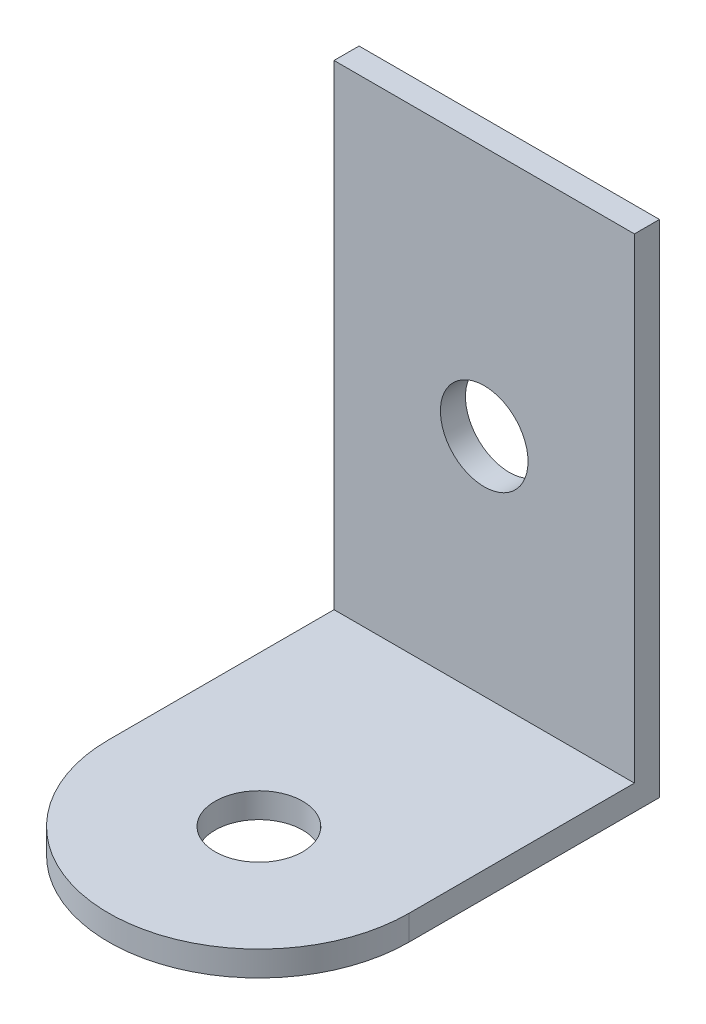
ISO-10303-21;
HEADER;
FILE_DESCRIPTION(('STEP AP214'),'2;1');
FILE_NAME('part.step','',(''),(''),'','','');
FILE_SCHEMA(('AUTOMOTIVE_DESIGN { 1 0 10303 214 1 1 1 1 }'));
ENDSEC;
DATA;
#1=APPLICATION_CONTEXT('core data for automotive mechanical design processes');
#2=APPLICATION_PROTOCOL_DEFINITION('international standard','automotive_design',2000,#1);
#3=PRODUCT_CONTEXT('',#1,'mechanical');
#4=PRODUCT('Part','Part','',(#3));
#5=PRODUCT_RELATED_PRODUCT_CATEGORY('part','',(#4));
#6=PRODUCT_DEFINITION_FORMATION('','',#4);
#7=PRODUCT_DEFINITION_CONTEXT('part definition',#1,'design');
#8=PRODUCT_DEFINITION('design','',#6,#7);
#9=PRODUCT_DEFINITION_SHAPE('','',#8);
#10=(LENGTH_UNIT() NAMED_UNIT(*) SI_UNIT(.MILLI.,.METRE.));
#11=(NAMED_UNIT(*) PLANE_ANGLE_UNIT() SI_UNIT($,.RADIAN.));
#12=(NAMED_UNIT(*) SI_UNIT($,.STERADIAN.) SOLID_ANGLE_UNIT());
#13=UNCERTAINTY_MEASURE_WITH_UNIT(LENGTH_MEASURE(1.E-05),#10,'distance_accuracy_value','');
#14=(GEOMETRIC_REPRESENTATION_CONTEXT(3) GLOBAL_UNCERTAINTY_ASSIGNED_CONTEXT((#13)) GLOBAL_UNIT_ASSIGNED_CONTEXT((#10,
#11,#12)) REPRESENTATION_CONTEXT('',''));
#15=CARTESIAN_POINT('',(0.,0.,0.));
#16=DIRECTION('',(0.,0.,1.));
#17=DIRECTION('',(1.,0.,0.));
#18=AXIS2_PLACEMENT_3D('',#15,#16,#17);
#19=CARTESIAN_POINT('',(0.,20.,1.));
#20=DIRECTION('',(0.,0.,-1.));
#21=DIRECTION('',(-1.,0.,0.));
#22=AXIS2_PLACEMENT_3D('',#19,#20,#21);
#23=PLANE('',#22);
#24=CARTESIAN_POINT('',(6.,10.,1.));
#25=DIRECTION('',(0.,0.,1.));
#26=DIRECTION('',(1.,0.,0.));
#27=AXIS2_PLACEMENT_3D('',#24,#25,#26);
#28=CIRCLE('',#27,1.75);
#29=CARTESIAN_POINT('',(7.75,10.,1.));
#30=VERTEX_POINT('',#29);
#31=EDGE_CURVE('E113',#30,#30,#28,.T.);
#32=ORIENTED_EDGE('',*,*,#31,.F.);
#33=EDGE_LOOP('',(#32));
#34=FACE_BOUND('',#33,.T.);
#35=DIRECTION('',(-1.,0.,0.));
#36=VECTOR('',#35,1.);
#37=CARTESIAN_POINT('',(0.,1.,1.));
#38=LINE('',#37,#36);
#39=CARTESIAN_POINT('',(12.,1.,1.));
#40=VERTEX_POINT('',#39);
#41=CARTESIAN_POINT('',(0.,1.,1.));
#42=VERTEX_POINT('',#41);
#43=EDGE_CURVE('E49',#40,#42,#38,.T.);
#44=ORIENTED_EDGE('',*,*,#43,.F.);
#45=DIRECTION('',(0.,1.,0.));
#46=VECTOR('',#45,1.);
#47=CARTESIAN_POINT('',(12.,0.,1.));
#48=LINE('',#47,#46);
#49=CARTESIAN_POINT('',(12.,20.,1.));
#50=VERTEX_POINT('',#49);
#51=EDGE_CURVE('E88',#40,#50,#48,.T.);
#52=ORIENTED_EDGE('',*,*,#51,.T.);
#53=DIRECTION('',(-1.,0.,0.));
#54=VECTOR('',#53,1.);
#55=CARTESIAN_POINT('',(0.,20.,1.));
#56=LINE('',#55,#54);
#57=CARTESIAN_POINT('',(0.,20.,1.));
#58=VERTEX_POINT('',#57);
#59=EDGE_CURVE('E122',#50,#58,#56,.T.);
#60=ORIENTED_EDGE('',*,*,#59,.T.);
#61=DIRECTION('',(0.,-1.,0.));
#62=VECTOR('',#61,1.);
#63=CARTESIAN_POINT('',(0.,0.,1.));
#64=LINE('',#63,#62);
#65=EDGE_CURVE('E45',#58,#42,#64,.T.);
#66=ORIENTED_EDGE('',*,*,#65,.T.);
#67=EDGE_LOOP('',(#44,#52,#60,#66));
#68=FACE_BOUND('',#67,.T.);
#69=ADVANCED_FACE('F30',(#34,#68),#23,.F.);
#70=CARTESIAN_POINT('',(0.,20.,0.));
#71=DIRECTION('',(0.,0.,-1.));
#72=DIRECTION('',(-1.,0.,0.));
#73=AXIS2_PLACEMENT_3D('',#70,#71,#72);
#74=PLANE('',#73);
#75=DIRECTION('',(1.,0.,0.));
#76=VECTOR('',#75,1.);
#77=CARTESIAN_POINT('',(0.,0.,0.));
#78=LINE('',#77,#76);
#79=CARTESIAN_POINT('',(0.,0.,0.));
#80=VERTEX_POINT('',#79);
#81=CARTESIAN_POINT('',(12.,0.,0.));
#82=VERTEX_POINT('',#81);
#83=EDGE_CURVE('E126',#80,#82,#78,.T.);
#84=ORIENTED_EDGE('',*,*,#83,.F.);
#85=DIRECTION('',(0.,-1.,0.));
#86=VECTOR('',#85,1.);
#87=CARTESIAN_POINT('',(0.,0.,0.));
#88=LINE('',#87,#86);
#89=CARTESIAN_POINT('',(0.,20.,0.));
#90=VERTEX_POINT('',#89);
#91=EDGE_CURVE('E116',#90,#80,#88,.T.);
#92=ORIENTED_EDGE('',*,*,#91,.F.);
#93=DIRECTION('',(-1.,0.,0.));
#94=VECTOR('',#93,1.);
#95=CARTESIAN_POINT('',(0.,20.,0.));
#96=LINE('',#95,#94);
#97=CARTESIAN_POINT('',(12.,20.,0.));
#98=VERTEX_POINT('',#97);
#99=EDGE_CURVE('E120',#98,#90,#96,.T.);
#100=ORIENTED_EDGE('',*,*,#99,.F.);
#101=DIRECTION('',(0.,1.,0.));
#102=VECTOR('',#101,1.);
#103=CARTESIAN_POINT('',(12.,0.,0.));
#104=LINE('',#103,#102);
#105=EDGE_CURVE('E128',#82,#98,#104,.T.);
#106=ORIENTED_EDGE('',*,*,#105,.F.);
#107=EDGE_LOOP('',(#84,#92,#100,#106));
#108=FACE_BOUND('',#107,.T.);
#109=CARTESIAN_POINT('',(6.,10.,0.));
#110=DIRECTION('',(0.,0.,1.));
#111=DIRECTION('',(1.,0.,0.));
#112=AXIS2_PLACEMENT_3D('',#109,#110,#111);
#113=CIRCLE('',#112,1.75);
#114=CARTESIAN_POINT('',(7.75,10.,0.));
#115=VERTEX_POINT('',#114);
#116=EDGE_CURVE('E112',#115,#115,#113,.T.);
#117=ORIENTED_EDGE('',*,*,#116,.T.);
#118=EDGE_LOOP('',(#117));
#119=FACE_BOUND('',#118,.T.);
#120=ADVANCED_FACE('F140',(#108,#119),#74,.T.);
#121=CARTESIAN_POINT('',(0.,0.,1.));
#122=DIRECTION('',(1.,0.,0.));
#123=DIRECTION('',(0.,1.,0.));
#124=AXIS2_PLACEMENT_3D('',#121,#122,#123);
#125=PLANE('',#124);
#126=DIRECTION('',(0.,0.,-1.));
#127=VECTOR('',#126,1.);
#128=CARTESIAN_POINT('',(0.,0.,1.));
#129=LINE('',#128,#127);
#130=CARTESIAN_POINT('',(0.,0.,10.));
#131=VERTEX_POINT('',#130);
#132=EDGE_CURVE('E11',#131,#80,#129,.T.);
#133=ORIENTED_EDGE('',*,*,#132,.F.);
#134=DIRECTION('',(0.,-1.,0.));
#135=VECTOR('',#134,1.);
#136=CARTESIAN_POINT('',(0.,1.,10.));
#137=LINE('',#136,#135);
#138=CARTESIAN_POINT('',(0.,1.,10.));
#139=VERTEX_POINT('',#138);
#140=EDGE_CURVE('E100',#139,#131,#137,.T.);
#141=ORIENTED_EDGE('',*,*,#140,.F.);
#142=DIRECTION('',(0.,0.,-1.));
#143=VECTOR('',#142,1.);
#144=CARTESIAN_POINT('',(0.,1.,0.));
#145=LINE('',#144,#143);
#146=EDGE_CURVE('E92',#139,#42,#145,.T.);
#147=ORIENTED_EDGE('',*,*,#146,.T.);
#148=ORIENTED_EDGE('',*,*,#65,.F.);
#149=DIRECTION('',(0.,0.,-1.));
#150=VECTOR('',#149,1.);
#151=CARTESIAN_POINT('',(0.,20.,1.));
#152=LINE('',#151,#150);
#153=EDGE_CURVE('E124',#58,#90,#152,.T.);
#154=ORIENTED_EDGE('',*,*,#153,.T.);
#155=ORIENTED_EDGE('',*,*,#91,.T.);
#156=EDGE_LOOP('',(#133,#141,#147,#148,#154,#155));
#157=FACE_BOUND('',#156,.T.);
#158=ADVANCED_FACE('F32',(#157),#125,.F.);
#159=CARTESIAN_POINT('',(0.,0.,1.));
#160=DIRECTION('',(0.,1.,0.));
#161=DIRECTION('',(-1.,0.,0.));
#162=AXIS2_PLACEMENT_3D('',#159,#160,#161);
#163=PLANE('',#162);
#164=ORIENTED_EDGE('',*,*,#83,.T.);
#165=DIRECTION('',(0.,0.,-1.));
#166=VECTOR('',#165,1.);
#167=CARTESIAN_POINT('',(12.,0.,1.));
#168=LINE('',#167,#166);
#169=CARTESIAN_POINT('',(12.,0.,10.));
#170=VERTEX_POINT('',#169);
#171=EDGE_CURVE('E38',#170,#82,#168,.T.);
#172=ORIENTED_EDGE('',*,*,#171,.F.);
#173=CARTESIAN_POINT('',(6.,0.,10.));
#174=DIRECTION('',(0.,-1.,0.));
#175=DIRECTION('',(1.,0.,0.));
#176=AXIS2_PLACEMENT_3D('',#173,#174,#175);
#177=CIRCLE('',#176,6.);
#178=EDGE_CURVE('E99',#170,#131,#177,.T.);
#179=ORIENTED_EDGE('',*,*,#178,.T.);
#180=ORIENTED_EDGE('',*,*,#132,.T.);
#181=EDGE_LOOP('',(#164,#172,#179,#180));
#182=FACE_BOUND('',#181,.T.);
#183=CARTESIAN_POINT('',(6.,0.,10.));
#184=DIRECTION('',(0.,-1.,0.));
#185=DIRECTION('',(1.,0.,0.));
#186=AXIS2_PLACEMENT_3D('',#183,#184,#185);
#187=CIRCLE('',#186,1.75);
#188=CARTESIAN_POINT('',(7.75,0.,10.));
#189=VERTEX_POINT('',#188);
#190=EDGE_CURVE('E149',#189,#189,#187,.T.);
#191=ORIENTED_EDGE('',*,*,#190,.F.);
#192=EDGE_LOOP('',(#191));
#193=FACE_BOUND('',#192,.T.);
#194=ADVANCED_FACE('F162',(#182,#193),#163,.F.);
#195=CARTESIAN_POINT('',(12.,0.,1.));
#196=DIRECTION('',(-1.,0.,0.));
#197=DIRECTION('',(0.,0.,1.));
#198=AXIS2_PLACEMENT_3D('',#195,#196,#197);
#199=PLANE('',#198);
#200=ORIENTED_EDGE('',*,*,#105,.T.);
#201=DIRECTION('',(0.,0.,-1.));
#202=VECTOR('',#201,1.);
#203=CARTESIAN_POINT('',(12.,20.,1.));
#204=LINE('',#203,#202);
#205=EDGE_CURVE('E133',#50,#98,#204,.T.);
#206=ORIENTED_EDGE('',*,*,#205,.F.);
#207=ORIENTED_EDGE('',*,*,#51,.F.);
#208=DIRECTION('',(0.,0.,1.));
#209=VECTOR('',#208,1.);
#210=CARTESIAN_POINT('',(12.,1.,0.));
#211=LINE('',#210,#209);
#212=CARTESIAN_POINT('',(12.,1.,10.));
#213=VERTEX_POINT('',#212);
#214=EDGE_CURVE('E81',#40,#213,#211,.T.);
#215=ORIENTED_EDGE('',*,*,#214,.T.);
#216=DIRECTION('',(0.,-1.,0.));
#217=VECTOR('',#216,1.);
#218=CARTESIAN_POINT('',(12.,1.,10.));
#219=LINE('',#218,#217);
#220=EDGE_CURVE('E85',#213,#170,#219,.T.);
#221=ORIENTED_EDGE('',*,*,#220,.T.);
#222=ORIENTED_EDGE('',*,*,#171,.T.);
#223=EDGE_LOOP('',(#200,#206,#207,#215,#221,#222));
#224=FACE_BOUND('',#223,.T.);
#225=ADVANCED_FACE('F83',(#224),#199,.F.);
#226=CARTESIAN_POINT('',(0.,20.,1.));
#227=DIRECTION('',(0.,-1.,0.));
#228=DIRECTION('',(1.,0.,0.));
#229=AXIS2_PLACEMENT_3D('',#226,#227,#228);
#230=PLANE('',#229);
#231=ORIENTED_EDGE('',*,*,#99,.T.);
#232=ORIENTED_EDGE('',*,*,#153,.F.);
#233=ORIENTED_EDGE('',*,*,#59,.F.);
#234=ORIENTED_EDGE('',*,*,#205,.T.);
#235=EDGE_LOOP('',(#231,#232,#233,#234));
#236=FACE_BOUND('',#235,.T.);
#237=ADVANCED_FACE('F145',(#236),#230,.F.);
#238=CARTESIAN_POINT('',(6.,10.,1.));
#239=DIRECTION('',(0.,0.,-1.));
#240=DIRECTION('',(-1.,0.,0.));
#241=AXIS2_PLACEMENT_3D('',#238,#239,#240);
#242=CYLINDRICAL_SURFACE('',#241,1.75);
#243=ORIENTED_EDGE('',*,*,#31,.T.);
#244=EDGE_LOOP('',(#243));
#245=FACE_BOUND('',#244,.T.);
#246=ORIENTED_EDGE('',*,*,#116,.F.);
#247=EDGE_LOOP('',(#246));
#248=FACE_BOUND('',#247,.T.);
#249=ADVANCED_FACE('F178',(#245,#248),#242,.F.);
#250=CARTESIAN_POINT('',(6.,1.,10.));
#251=DIRECTION('',(0.,-1.,0.));
#252=DIRECTION('',(1.,0.,0.));
#253=AXIS2_PLACEMENT_3D('',#250,#251,#252);
#254=PLANE('',#253);
#255=CARTESIAN_POINT('',(6.,1.,10.));
#256=DIRECTION('',(0.,-1.,0.));
#257=DIRECTION('',(1.,0.,0.));
#258=AXIS2_PLACEMENT_3D('',#255,#256,#257);
#259=CIRCLE('',#258,1.75);
#260=CARTESIAN_POINT('',(7.75,1.,10.));
#261=VERTEX_POINT('',#260);
#262=EDGE_CURVE('E109',#261,#261,#259,.T.);
#263=ORIENTED_EDGE('',*,*,#262,.T.);
#264=EDGE_LOOP('',(#263));
#265=FACE_BOUND('',#264,.T.);
#266=ORIENTED_EDGE('',*,*,#214,.F.);
#267=ORIENTED_EDGE('',*,*,#43,.T.);
#268=ORIENTED_EDGE('',*,*,#146,.F.);
#269=CARTESIAN_POINT('',(6.,1.,10.));
#270=DIRECTION('',(0.,-1.,0.));
#271=DIRECTION('',(1.,0.,0.));
#272=AXIS2_PLACEMENT_3D('',#269,#270,#271);
#273=CIRCLE('',#272,6.);
#274=EDGE_CURVE('E91',#213,#139,#273,.T.);
#275=ORIENTED_EDGE('',*,*,#274,.F.);
#276=EDGE_LOOP('',(#266,#267,#268,#275));
#277=FACE_BOUND('',#276,.T.);
#278=ADVANCED_FACE('F103',(#265,#277),#254,.F.);
#279=CARTESIAN_POINT('',(6.,1.,10.));
#280=DIRECTION('',(0.,-1.,0.));
#281=DIRECTION('',(1.,0.,0.));
#282=AXIS2_PLACEMENT_3D('',#279,#280,#281);
#283=CYLINDRICAL_SURFACE('',#282,6.);
#284=ORIENTED_EDGE('',*,*,#178,.F.);
#285=ORIENTED_EDGE('',*,*,#220,.F.);
#286=ORIENTED_EDGE('',*,*,#274,.T.);
#287=ORIENTED_EDGE('',*,*,#140,.T.);
#288=EDGE_LOOP('',(#284,#285,#286,#287));
#289=FACE_BOUND('',#288,.T.);
#290=ADVANCED_FACE('F96',(#289),#283,.T.);
#291=CARTESIAN_POINT('',(6.,1.,10.));
#292=DIRECTION('',(0.,-1.,0.));
#293=DIRECTION('',(1.,0.,0.));
#294=AXIS2_PLACEMENT_3D('',#291,#292,#293);
#295=CYLINDRICAL_SURFACE('',#294,1.75);
#296=ORIENTED_EDGE('',*,*,#262,.F.);
#297=EDGE_LOOP('',(#296));
#298=FACE_BOUND('',#297,.T.);
#299=ORIENTED_EDGE('',*,*,#190,.T.);
#300=EDGE_LOOP('',(#299));
#301=FACE_BOUND('',#300,.T.);
#302=ADVANCED_FACE('F156',(#298,#301),#295,.F.);
#303=CLOSED_SHELL('',(#69,#120,#158,#194,#225,#237,#249,#278,#290,#302));
#304=MANIFOLD_SOLID_BREP('B2',#303);
#305=ADVANCED_BREP_SHAPE_REPRESENTATION('',(#18,#304),#14);
#306=SHAPE_DEFINITION_REPRESENTATION(#9,#305);
ENDSEC;
END-ISO-10303-21;
